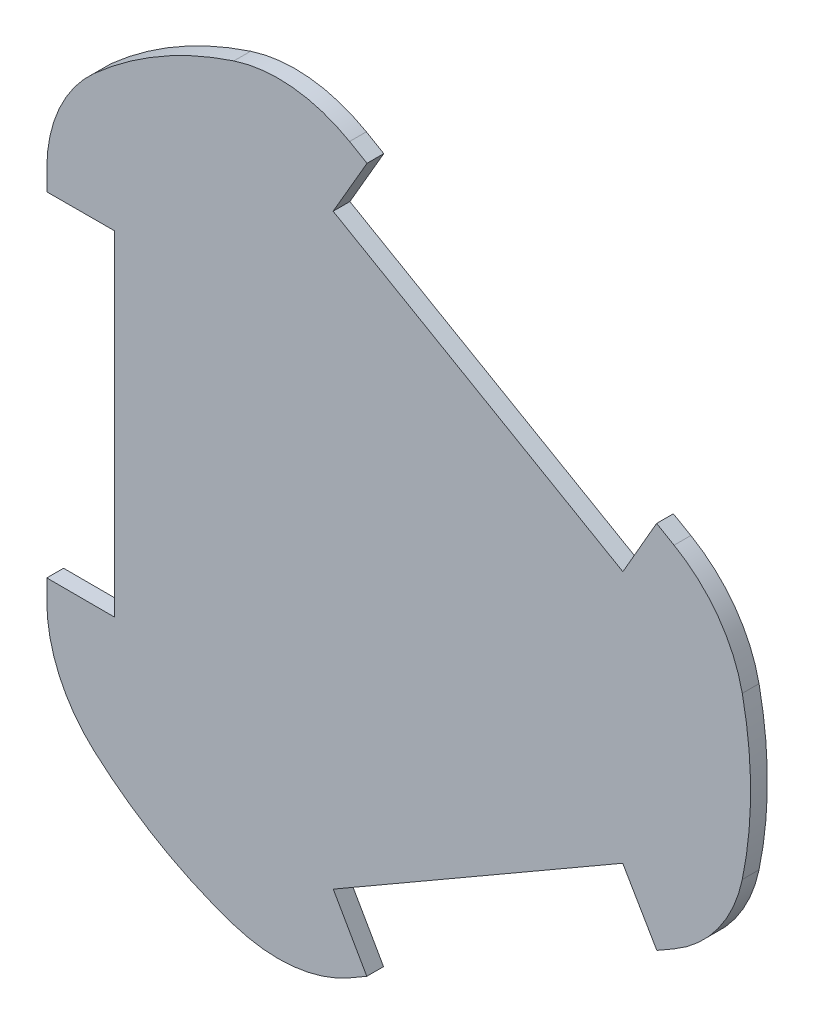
ISO-10303-21;
HEADER;
FILE_DESCRIPTION(('STEP AP214'),'2;1');
FILE_NAME('part.step','',(''),(''),'','','');
FILE_SCHEMA(('AUTOMOTIVE_DESIGN { 1 0 10303 214 1 1 1 1 }'));
ENDSEC;
DATA;
#1=APPLICATION_CONTEXT('core data for automotive mechanical design processes');
#2=APPLICATION_PROTOCOL_DEFINITION('international standard','automotive_design',2000,#1);
#3=PRODUCT_CONTEXT('',#1,'mechanical');
#4=PRODUCT('Part','Part','',(#3));
#5=PRODUCT_RELATED_PRODUCT_CATEGORY('part','',(#4));
#6=PRODUCT_DEFINITION_FORMATION('','',#4);
#7=PRODUCT_DEFINITION_CONTEXT('part definition',#1,'design');
#8=PRODUCT_DEFINITION('design','',#6,#7);
#9=PRODUCT_DEFINITION_SHAPE('','',#8);
#10=(LENGTH_UNIT() NAMED_UNIT(*) SI_UNIT(.MILLI.,.METRE.));
#11=(NAMED_UNIT(*) PLANE_ANGLE_UNIT() SI_UNIT($,.RADIAN.));
#12=(NAMED_UNIT(*) SI_UNIT($,.STERADIAN.) SOLID_ANGLE_UNIT());
#13=UNCERTAINTY_MEASURE_WITH_UNIT(LENGTH_MEASURE(1.E-05),#10,'distance_accuracy_value','');
#14=(GEOMETRIC_REPRESENTATION_CONTEXT(3) GLOBAL_UNCERTAINTY_ASSIGNED_CONTEXT((#13)) GLOBAL_UNIT_ASSIGNED_CONTEXT((#10,
#11,#12)) REPRESENTATION_CONTEXT('',''));
#15=CARTESIAN_POINT('',(0.,0.,0.));
#16=DIRECTION('',(0.,0.,1.));
#17=DIRECTION('',(1.,0.,0.));
#18=AXIS2_PLACEMENT_3D('',#15,#16,#17);
#19=CARTESIAN_POINT('',(24.3649167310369,6.14016818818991,0.));
#20=DIRECTION('',(0.,0.,1.));
#21=DIRECTION('',(1.,0.,0.));
#22=AXIS2_PLACEMENT_3D('',#19,#20,#21);
#23=PLANE('',#22);
#24=CARTESIAN_POINT('',(34.9999999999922,3.2533004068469E-11,0.));
#25=DIRECTION('',(0.,0.,1.));
#26=DIRECTION('',(1.,0.,0.));
#27=AXIS2_PLACEMENT_3D('',#24,#25,#26);
#28=CIRCLE('',#27,4.);
#29=CARTESIAN_POINT('',(38.9999999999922,3.2533004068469E-11,0.));
#30=VERTEX_POINT('',#29);
#31=EDGE_CURVE('E48',#30,#30,#28,.F.);
#32=ORIENTED_EDGE('',*,*,#31,.F.);
#33=EDGE_LOOP('',(#32));
#34=FACE_BOUND('',#33,.T.);
#35=DIRECTION('',(-0.498246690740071,-0.867035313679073,0.));
#36=VECTOR('',#35,1.);
#37=CARTESIAN_POINT('',(26.7547595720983,15.0665843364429,0.));
#38=LINE('',#37,#36);
#39=CARTESIAN_POINT('',(30.7778982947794,22.0675407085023,0.));
#40=VERTEX_POINT('',#39);
#41=CARTESIAN_POINT('',(26.7547595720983,15.0665843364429,0.));
#42=VERTEX_POINT('',#41);
#43=EDGE_CURVE('E258',#40,#42,#38,.T.);
#44=ORIENTED_EDGE('',*,*,#43,.F.);
#45=DIRECTION('',(-0.866025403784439,0.499999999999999,0.));
#46=VECTOR('',#45,1.);
#47=CARTESIAN_POINT('',(32.8649167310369,20.8626000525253,0.));
#48=LINE('',#47,#46);
#49=CARTESIAN_POINT('',(32.8649167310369,20.8626000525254,0.));
#50=VERTEX_POINT('',#49);
#51=EDGE_CURVE('E149',#50,#40,#48,.T.);
#52=ORIENTED_EDGE('',*,*,#51,.F.);
#53=CARTESIAN_POINT('',(24.3649167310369,6.14016818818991,0.));
#54=DIRECTION('',(0.,0.,1.));
#55=DIRECTION('',(1.,0.,0.));
#56=AXIS2_PLACEMENT_3D('',#53,#54,#55);
#57=CIRCLE('',#56,17.);
#58=CARTESIAN_POINT('',(41.0050362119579,9.61959682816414,0.));
#59=VERTEX_POINT('',#58);
#60=EDGE_CURVE('E143',#59,#50,#57,.T.);
#61=ORIENTED_EDGE('',*,*,#60,.F.);
#62=CARTESIAN_POINT('',(-5.0000000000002,0.,0.));
#63=DIRECTION('',(0.,0.,1.));
#64=DIRECTION('',(1.,0.,0.));
#65=AXIS2_PLACEMENT_3D('',#62,#63,#64);
#66=CIRCLE('',#65,47.);
#67=CARTESIAN_POINT('',(41.0050362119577,-9.61959682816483,0.));
#68=VERTEX_POINT('',#67);
#69=EDGE_CURVE('E244',#68,#59,#66,.T.);
#70=ORIENTED_EDGE('',*,*,#69,.F.);
#71=CARTESIAN_POINT('',(24.3649167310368,-6.14016818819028,0.));
#72=DIRECTION('',(0.,0.,1.));
#73=DIRECTION('',(1.,0.,0.));
#74=AXIS2_PLACEMENT_3D('',#71,#72,#73);
#75=CIRCLE('',#74,17.);
#76=CARTESIAN_POINT('',(32.8649167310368,-20.8626000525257,0.));
#77=VERTEX_POINT('',#76);
#78=EDGE_CURVE('E319',#77,#68,#75,.T.);
#79=ORIENTED_EDGE('',*,*,#78,.F.);
#80=DIRECTION('',(0.866025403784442,0.499999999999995,0.));
#81=VECTOR('',#80,1.);
#82=CARTESIAN_POINT('',(30.8072038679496,-22.0506211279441,0.));
#83=LINE('',#82,#81);
#84=CARTESIAN_POINT('',(30.8072038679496,-22.0506211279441,0.));
#85=VERTEX_POINT('',#84);
#86=EDGE_CURVE('E316',#85,#77,#83,.T.);
#87=ORIENTED_EDGE('',*,*,#86,.F.);
#88=DIRECTION('',(0.504242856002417,-0.863561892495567,0.));
#89=VECTOR('',#88,1.);
#90=CARTESIAN_POINT('',(26.7356087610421,-15.0776430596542,0.));
#91=LINE('',#90,#89);
#92=CARTESIAN_POINT('',(26.7356087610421,-15.0776430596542,0.));
#93=VERTEX_POINT('',#92);
#94=EDGE_CURVE('E314',#93,#85,#91,.T.);
#95=ORIENTED_EDGE('',*,*,#94,.F.);
#96=DIRECTION('',(0.866025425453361,0.499999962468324,0.));
#97=VECTOR('',#96,1.);
#98=CARTESIAN_POINT('',(-7.811356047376,-35.0233404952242,0.));
#99=LINE('',#98,#97);
#100=CARTESIAN_POINT('',(-7.811356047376,-35.0233404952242,0.));
#101=VERTEX_POINT('',#100);
#102=EDGE_CURVE('E311',#101,#93,#99,.T.);
#103=ORIENTED_EDGE('',*,*,#102,.F.);
#104=DIRECTION('',(-0.495744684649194,0.868468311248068,0.));
#105=VECTOR('',#104,1.);
#106=CARTESIAN_POINT('',(-3.80838001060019,-42.0359377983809,0.));
#107=LINE('',#106,#105);
#108=CARTESIAN_POINT('',(-3.80838001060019,-42.0359377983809,0.));
#109=VERTEX_POINT('',#108);
#110=EDGE_CURVE('E308',#109,#101,#107,.T.);
#111=ORIENTED_EDGE('',*,*,#110,.F.);
#112=DIRECTION('',(0.86602540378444,0.499999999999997,0.));
#113=VECTOR('',#112,1.);
#114=CARTESIAN_POINT('',(-5.86491673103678,-43.2232798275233,0.));
#115=LINE('',#114,#113);
#116=CARTESIAN_POINT('',(-5.86491673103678,-43.2232798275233,0.));
#117=VERTEX_POINT('',#116);
#118=EDGE_CURVE('E306',#117,#109,#115,.T.);
#119=ORIENTED_EDGE('',*,*,#118,.F.);
#120=CARTESIAN_POINT('',(-14.3649167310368,-28.5008479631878,0.));
#121=DIRECTION('',(0.,0.,1.));
#122=DIRECTION('',(1.,0.,0.));
#123=AXIS2_PLACEMENT_3D('',#120,#121,#122);
#124=CIRCLE('',#123,17.);
#125=CARTESIAN_POINT('',(-19.6717028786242,-44.6513284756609,0.));
#126=VERTEX_POINT('',#125);
#127=EDGE_CURVE('E303',#126,#117,#124,.T.);
#128=ORIENTED_EDGE('',*,*,#127,.F.);
#129=CARTESIAN_POINT('',(-5.0000000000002,0.,0.));
#130=DIRECTION('',(0.,0.,1.));
#131=DIRECTION('',(1.,0.,0.));
#132=AXIS2_PLACEMENT_3D('',#129,#130,#131);
#133=CIRCLE('',#132,47.);
#134=CARTESIAN_POINT('',(-36.3333333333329,-35.0317316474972,0.));
#135=VERTEX_POINT('',#134);
#136=EDGE_CURVE('E299',#135,#126,#133,.T.);
#137=ORIENTED_EDGE('',*,*,#136,.F.);
#138=CARTESIAN_POINT('',(-24.9999999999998,-22.3606797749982,0.));
#139=DIRECTION('',(0.,0.,1.));
#140=DIRECTION('',(1.,0.,0.));
#141=AXIS2_PLACEMENT_3D('',#138,#139,#140);
#142=CIRCLE('',#141,17.);
#143=CARTESIAN_POINT('',(-41.9999999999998,-22.3606797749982,0.));
#144=VERTEX_POINT('',#143);
#145=EDGE_CURVE('E296',#144,#135,#142,.T.);
#146=ORIENTED_EDGE('',*,*,#145,.F.);
#147=DIRECTION('',(0.,-1.,0.));
#148=VECTOR('',#147,1.);
#149=CARTESIAN_POINT('',(-41.9999999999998,-19.9494445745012,0.));
#150=LINE('',#149,#148);
#151=CARTESIAN_POINT('',(-41.9999999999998,-19.9494445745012,0.));
#152=VERTEX_POINT('',#151);
#153=EDGE_CURVE('E293',#152,#144,#150,.T.);
#154=ORIENTED_EDGE('',*,*,#153,.F.);
#155=DIRECTION('',(-0.999997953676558,0.00202302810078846,0.));
#156=VECTOR('',#155,1.);
#157=CARTESIAN_POINT('',(-33.9254246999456,-19.9657797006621,0.));
#158=LINE('',#157,#156);
#159=CARTESIAN_POINT('',(-33.9254246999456,-19.9657797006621,0.));
#160=VERTEX_POINT('',#159);
#161=EDGE_CURVE('E290',#160,#152,#158,.T.);
#162=ORIENTED_EDGE('',*,*,#161,.F.);
#163=DIRECTION('',(0.,-1.,0.));
#164=VECTOR('',#163,1.);
#165=CARTESIAN_POINT('',(-33.9254246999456,19.967136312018,0.));
#166=LINE('',#165,#164);
#167=CARTESIAN_POINT('',(-33.9254246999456,19.967136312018,0.));
#168=VERTEX_POINT('',#167);
#169=EDGE_CURVE('E287',#168,#160,#166,.T.);
#170=ORIENTED_EDGE('',*,*,#169,.F.);
#171=DIRECTION('',(0.999997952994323,0.0020233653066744,0.));
#172=VECTOR('',#171,1.);
#173=CARTESIAN_POINT('',(-41.9999999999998,19.950798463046,0.));
#174=LINE('',#173,#172);
#175=CARTESIAN_POINT('',(-41.9999999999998,19.950798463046,0.));
#176=VERTEX_POINT('',#175);
#177=EDGE_CURVE('E284',#176,#168,#174,.T.);
#178=ORIENTED_EDGE('',*,*,#177,.F.);
#179=DIRECTION('',(0.,-1.,0.));
#180=VECTOR('',#179,1.);
#181=CARTESIAN_POINT('',(-41.9999999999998,22.3606797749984,0.));
#182=LINE('',#181,#180);
#183=CARTESIAN_POINT('',(-41.9999999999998,22.3606797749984,0.));
#184=VERTEX_POINT('',#183);
#185=EDGE_CURVE('E281',#184,#176,#182,.T.);
#186=ORIENTED_EDGE('',*,*,#185,.F.);
#187=CARTESIAN_POINT('',(-24.9999999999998,22.3606797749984,0.));
#188=DIRECTION('',(0.,0.,1.));
#189=DIRECTION('',(1.,0.,0.));
#190=AXIS2_PLACEMENT_3D('',#187,#188,#189);
#191=CIRCLE('',#190,17.);
#192=CARTESIAN_POINT('',(-36.3333333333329,35.0317316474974,0.));
#193=VERTEX_POINT('',#192);
#194=EDGE_CURVE('E279',#193,#184,#191,.T.);
#195=ORIENTED_EDGE('',*,*,#194,.F.);
#196=CARTESIAN_POINT('',(-5.0000000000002,0.,0.));
#197=DIRECTION('',(0.,0.,1.));
#198=DIRECTION('',(1.,0.,0.));
#199=AXIS2_PLACEMENT_3D('',#196,#197,#198);
#200=CIRCLE('',#199,47.);
#201=CARTESIAN_POINT('',(-19.671702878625,44.6513284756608,0.));
#202=VERTEX_POINT('',#201);
#203=EDGE_CURVE('E275',#202,#193,#200,.T.);
#204=ORIENTED_EDGE('',*,*,#203,.F.);
#205=CARTESIAN_POINT('',(-14.3649167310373,28.5008479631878,0.));
#206=DIRECTION('',(0.,0.,1.));
#207=DIRECTION('',(1.,0.,0.));
#208=AXIS2_PLACEMENT_3D('',#205,#206,#207);
#209=CIRCLE('',#208,17.);
#210=CARTESIAN_POINT('',(-5.86491673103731,43.2232798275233,0.));
#211=VERTEX_POINT('',#210);
#212=EDGE_CURVE('E272',#211,#202,#209,.T.);
#213=ORIENTED_EDGE('',*,*,#212,.F.);
#214=DIRECTION('',(-0.866025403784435,0.500000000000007,0.));
#215=VECTOR('',#214,1.);
#216=CARTESIAN_POINT('',(-3.77672579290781,42.0176622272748,0.));
#217=LINE('',#216,#215);
#218=CARTESIAN_POINT('',(-3.77672579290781,42.0176622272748,0.));
#219=VERTEX_POINT('',#218);
#220=EDGE_CURVE('E268',#219,#211,#217,.T.);
#221=ORIENTED_EDGE('',*,*,#220,.F.);
#222=DIRECTION('',(0.501750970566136,0.865012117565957,0.));
#223=VECTOR('',#222,1.);
#224=CARTESIAN_POINT('',(-7.82815927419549,35.0330438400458,0.));
#225=LINE('',#224,#223);
#226=CARTESIAN_POINT('',(-7.82815927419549,35.0330438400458,0.));
#227=VERTEX_POINT('',#226);
#228=EDGE_CURVE('E265',#227,#219,#225,.T.);
#229=ORIENTED_EDGE('',*,*,#228,.F.);
#230=DIRECTION('',(-0.866025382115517,0.500000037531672,0.));
#231=VECTOR('',#230,1.);
#232=CARTESIAN_POINT('',(26.7547595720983,15.0665843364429,0.));
#233=LINE('',#232,#231);
#234=EDGE_CURVE('E261',#42,#227,#233,.T.);
#235=ORIENTED_EDGE('',*,*,#234,.F.);
#236=EDGE_LOOP('',(#44,#52,#61,#70,#79,#87,#95,#103,#111,#119,#128,#137,#146,#154,#162,#170,
#178,#186,#195,#204,#213,#221,#229,#235));
#237=FACE_BOUND('',#236,.T.);
#238=CARTESIAN_POINT('',(-25.0000000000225,34.6410161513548,0.));
#239=DIRECTION('',(0.,0.,1.));
#240=DIRECTION('',(1.,0.,0.));
#241=AXIS2_PLACEMENT_3D('',#238,#239,#240);
#242=CIRCLE('',#241,4.);
#243=CARTESIAN_POINT('',(-21.0000000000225,34.6410161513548,0.));
#244=VERTEX_POINT('',#243);
#245=EDGE_CURVE('E398',#244,#244,#242,.F.);
#246=ORIENTED_EDGE('',*,*,#245,.F.);
#247=EDGE_LOOP('',(#246));
#248=FACE_BOUND('',#247,.T.);
#249=CARTESIAN_POINT('',(-24.9999999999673,-34.6410161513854,0.));
#250=DIRECTION('',(0.,0.,1.));
#251=DIRECTION('',(1.,0.,0.));
#252=AXIS2_PLACEMENT_3D('',#249,#250,#251);
#253=CIRCLE('',#252,4.);
#254=CARTESIAN_POINT('',(-20.9999999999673,-34.6410161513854,0.));
#255=VERTEX_POINT('',#254);
#256=EDGE_CURVE('E11',#255,#255,#253,.F.);
#257=ORIENTED_EDGE('',*,*,#256,.F.);
#258=EDGE_LOOP('',(#257));
#259=FACE_BOUND('',#258,.T.);
#260=ADVANCED_FACE('F38',(#34,#237,#248,#259),#23,.F.);
#261=CARTESIAN_POINT('',(24.3649167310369,6.14016818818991,2.));
#262=DIRECTION('',(0.,0.,1.));
#263=DIRECTION('',(1.,0.,0.));
#264=AXIS2_PLACEMENT_3D('',#261,#262,#263);
#265=PLANE('',#264);
#266=DIRECTION('',(-0.498246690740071,-0.867035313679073,0.));
#267=VECTOR('',#266,1.);
#268=CARTESIAN_POINT('',(26.7547595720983,15.0665843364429,2.));
#269=LINE('',#268,#267);
#270=CARTESIAN_POINT('',(30.7778982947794,22.0675407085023,2.));
#271=VERTEX_POINT('',#270);
#272=CARTESIAN_POINT('',(26.7547595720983,15.0665843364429,2.));
#273=VERTEX_POINT('',#272);
#274=EDGE_CURVE('E325',#271,#273,#269,.T.);
#275=ORIENTED_EDGE('',*,*,#274,.T.);
#276=DIRECTION('',(-0.866025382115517,0.500000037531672,0.));
#277=VECTOR('',#276,1.);
#278=CARTESIAN_POINT('',(26.7547595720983,15.0665843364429,2.));
#279=LINE('',#278,#277);
#280=CARTESIAN_POINT('',(-7.82815927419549,35.0330438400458,2.));
#281=VERTEX_POINT('',#280);
#282=EDGE_CURVE('E158',#273,#281,#279,.T.);
#283=ORIENTED_EDGE('',*,*,#282,.T.);
#284=DIRECTION('',(0.501750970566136,0.865012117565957,0.));
#285=VECTOR('',#284,1.);
#286=CARTESIAN_POINT('',(-7.82815927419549,35.0330438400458,2.));
#287=LINE('',#286,#285);
#288=CARTESIAN_POINT('',(-3.77672579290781,42.0176622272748,2.));
#289=VERTEX_POINT('',#288);
#290=EDGE_CURVE('E536',#281,#289,#287,.T.);
#291=ORIENTED_EDGE('',*,*,#290,.T.);
#292=DIRECTION('',(-0.866025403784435,0.500000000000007,0.));
#293=VECTOR('',#292,1.);
#294=CARTESIAN_POINT('',(-3.77672579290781,42.0176622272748,2.));
#295=LINE('',#294,#293);
#296=CARTESIAN_POINT('',(-5.86491673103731,43.2232798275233,2.));
#297=VERTEX_POINT('',#296);
#298=EDGE_CURVE('E547',#289,#297,#295,.T.);
#299=ORIENTED_EDGE('',*,*,#298,.T.);
#300=CARTESIAN_POINT('',(-14.3649167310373,28.5008479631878,2.));
#301=DIRECTION('',(0.,0.,1.));
#302=DIRECTION('',(1.,0.,0.));
#303=AXIS2_PLACEMENT_3D('',#300,#301,#302);
#304=CIRCLE('',#303,17.);
#305=CARTESIAN_POINT('',(-19.671702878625,44.6513284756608,2.));
#306=VERTEX_POINT('',#305);
#307=EDGE_CURVE('E543',#297,#306,#304,.T.);
#308=ORIENTED_EDGE('',*,*,#307,.T.);
#309=CARTESIAN_POINT('',(-5.0000000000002,0.,2.));
#310=DIRECTION('',(0.,0.,1.));
#311=DIRECTION('',(1.,0.,0.));
#312=AXIS2_PLACEMENT_3D('',#309,#310,#311);
#313=CIRCLE('',#312,47.);
#314=CARTESIAN_POINT('',(-36.3333333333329,35.0317316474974,2.));
#315=VERTEX_POINT('',#314);
#316=EDGE_CURVE('E546',#306,#315,#313,.T.);
#317=ORIENTED_EDGE('',*,*,#316,.T.);
#318=CARTESIAN_POINT('',(-24.9999999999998,22.3606797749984,2.));
#319=DIRECTION('',(0.,0.,1.));
#320=DIRECTION('',(1.,0.,0.));
#321=AXIS2_PLACEMENT_3D('',#318,#319,#320);
#322=CIRCLE('',#321,17.);
#323=CARTESIAN_POINT('',(-41.9999999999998,22.3606797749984,2.));
#324=VERTEX_POINT('',#323);
#325=EDGE_CURVE('E550',#315,#324,#322,.T.);
#326=ORIENTED_EDGE('',*,*,#325,.T.);
#327=DIRECTION('',(0.,-1.,0.));
#328=VECTOR('',#327,1.);
#329=CARTESIAN_POINT('',(-41.9999999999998,22.3606797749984,2.));
#330=LINE('',#329,#328);
#331=CARTESIAN_POINT('',(-41.9999999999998,19.950798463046,2.));
#332=VERTEX_POINT('',#331);
#333=EDGE_CURVE('E557',#324,#332,#330,.T.);
#334=ORIENTED_EDGE('',*,*,#333,.T.);
#335=DIRECTION('',(0.999997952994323,0.0020233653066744,0.));
#336=VECTOR('',#335,1.);
#337=CARTESIAN_POINT('',(-41.9999999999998,19.950798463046,2.));
#338=LINE('',#337,#336);
#339=CARTESIAN_POINT('',(-33.9254246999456,19.967136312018,2.));
#340=VERTEX_POINT('',#339);
#341=EDGE_CURVE('E559',#332,#340,#338,.T.);
#342=ORIENTED_EDGE('',*,*,#341,.T.);
#343=DIRECTION('',(0.,-1.,0.));
#344=VECTOR('',#343,1.);
#345=CARTESIAN_POINT('',(-33.9254246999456,19.967136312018,2.));
#346=LINE('',#345,#344);
#347=CARTESIAN_POINT('',(-33.9254246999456,-19.9657797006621,2.));
#348=VERTEX_POINT('',#347);
#349=EDGE_CURVE('E561',#340,#348,#346,.T.);
#350=ORIENTED_EDGE('',*,*,#349,.T.);
#351=DIRECTION('',(-0.999997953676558,0.00202302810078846,0.));
#352=VECTOR('',#351,1.);
#353=CARTESIAN_POINT('',(-33.9254246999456,-19.9657797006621,2.));
#354=LINE('',#353,#352);
#355=CARTESIAN_POINT('',(-41.9999999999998,-19.9494445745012,2.));
#356=VERTEX_POINT('',#355);
#357=EDGE_CURVE('E564',#348,#356,#354,.T.);
#358=ORIENTED_EDGE('',*,*,#357,.T.);
#359=DIRECTION('',(0.,-1.,0.));
#360=VECTOR('',#359,1.);
#361=CARTESIAN_POINT('',(-41.9999999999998,-19.9494445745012,2.));
#362=LINE('',#361,#360);
#363=CARTESIAN_POINT('',(-41.9999999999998,-22.3606797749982,2.));
#364=VERTEX_POINT('',#363);
#365=EDGE_CURVE('E567',#356,#364,#362,.T.);
#366=ORIENTED_EDGE('',*,*,#365,.T.);
#367=CARTESIAN_POINT('',(-24.9999999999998,-22.3606797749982,2.));
#368=DIRECTION('',(0.,0.,1.));
#369=DIRECTION('',(1.,0.,0.));
#370=AXIS2_PLACEMENT_3D('',#367,#368,#369);
#371=CIRCLE('',#370,17.);
#372=CARTESIAN_POINT('',(-36.3333333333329,-35.0317316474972,2.));
#373=VERTEX_POINT('',#372);
#374=EDGE_CURVE('E569',#364,#373,#371,.T.);
#375=ORIENTED_EDGE('',*,*,#374,.T.);
#376=CARTESIAN_POINT('',(-5.0000000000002,0.,2.));
#377=DIRECTION('',(0.,0.,1.));
#378=DIRECTION('',(1.,0.,0.));
#379=AXIS2_PLACEMENT_3D('',#376,#377,#378);
#380=CIRCLE('',#379,47.);
#381=CARTESIAN_POINT('',(-19.6717028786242,-44.6513284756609,2.));
#382=VERTEX_POINT('',#381);
#383=EDGE_CURVE('E572',#373,#382,#380,.T.);
#384=ORIENTED_EDGE('',*,*,#383,.T.);
#385=CARTESIAN_POINT('',(-14.3649167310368,-28.5008479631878,2.));
#386=DIRECTION('',(0.,0.,1.));
#387=DIRECTION('',(1.,0.,0.));
#388=AXIS2_PLACEMENT_3D('',#385,#386,#387);
#389=CIRCLE('',#388,17.);
#390=CARTESIAN_POINT('',(-5.86491673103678,-43.2232798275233,2.));
#391=VERTEX_POINT('',#390);
#392=EDGE_CURVE('E575',#382,#391,#389,.T.);
#393=ORIENTED_EDGE('',*,*,#392,.T.);
#394=DIRECTION('',(0.86602540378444,0.499999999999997,0.));
#395=VECTOR('',#394,1.);
#396=CARTESIAN_POINT('',(-5.86491673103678,-43.2232798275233,2.));
#397=LINE('',#396,#395);
#398=CARTESIAN_POINT('',(-3.80838001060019,-42.0359377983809,2.));
#399=VERTEX_POINT('',#398);
#400=EDGE_CURVE('E578',#391,#399,#397,.T.);
#401=ORIENTED_EDGE('',*,*,#400,.T.);
#402=DIRECTION('',(-0.495744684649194,0.868468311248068,0.));
#403=VECTOR('',#402,1.);
#404=CARTESIAN_POINT('',(-3.80838001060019,-42.0359377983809,2.));
#405=LINE('',#404,#403);
#406=CARTESIAN_POINT('',(-7.811356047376,-35.0233404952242,2.));
#407=VERTEX_POINT('',#406);
#408=EDGE_CURVE('E580',#399,#407,#405,.T.);
#409=ORIENTED_EDGE('',*,*,#408,.T.);
#410=DIRECTION('',(0.866025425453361,0.499999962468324,0.));
#411=VECTOR('',#410,1.);
#412=CARTESIAN_POINT('',(-7.811356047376,-35.0233404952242,2.));
#413=LINE('',#412,#411);
#414=CARTESIAN_POINT('',(26.7356087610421,-15.0776430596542,2.));
#415=VERTEX_POINT('',#414);
#416=EDGE_CURVE('E583',#407,#415,#413,.T.);
#417=ORIENTED_EDGE('',*,*,#416,.T.);
#418=DIRECTION('',(0.504242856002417,-0.863561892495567,0.));
#419=VECTOR('',#418,1.);
#420=CARTESIAN_POINT('',(26.7356087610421,-15.0776430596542,2.));
#421=LINE('',#420,#419);
#422=CARTESIAN_POINT('',(30.8072038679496,-22.0506211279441,2.));
#423=VERTEX_POINT('',#422);
#424=EDGE_CURVE('E586',#415,#423,#421,.T.);
#425=ORIENTED_EDGE('',*,*,#424,.T.);
#426=DIRECTION('',(0.866025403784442,0.499999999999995,0.));
#427=VECTOR('',#426,1.);
#428=CARTESIAN_POINT('',(30.8072038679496,-22.0506211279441,2.));
#429=LINE('',#428,#427);
#430=CARTESIAN_POINT('',(32.8649167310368,-20.8626000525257,2.));
#431=VERTEX_POINT('',#430);
#432=EDGE_CURVE('E588',#423,#431,#429,.T.);
#433=ORIENTED_EDGE('',*,*,#432,.T.);
#434=CARTESIAN_POINT('',(24.3649167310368,-6.14016818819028,2.));
#435=DIRECTION('',(0.,0.,1.));
#436=DIRECTION('',(1.,0.,0.));
#437=AXIS2_PLACEMENT_3D('',#434,#435,#436);
#438=CIRCLE('',#437,17.);
#439=CARTESIAN_POINT('',(41.0050362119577,-9.61959682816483,2.));
#440=VERTEX_POINT('',#439);
#441=EDGE_CURVE('E234',#431,#440,#438,.T.);
#442=ORIENTED_EDGE('',*,*,#441,.T.);
#443=CARTESIAN_POINT('',(-5.0000000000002,0.,2.));
#444=DIRECTION('',(0.,0.,1.));
#445=DIRECTION('',(1.,0.,0.));
#446=AXIS2_PLACEMENT_3D('',#443,#444,#445);
#447=CIRCLE('',#446,47.);
#448=CARTESIAN_POINT('',(41.0050362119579,9.61959682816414,2.));
#449=VERTEX_POINT('',#448);
#450=EDGE_CURVE('E228',#440,#449,#447,.T.);
#451=ORIENTED_EDGE('',*,*,#450,.T.);
#452=CARTESIAN_POINT('',(24.3649167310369,6.14016818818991,2.));
#453=DIRECTION('',(0.,0.,1.));
#454=DIRECTION('',(1.,0.,0.));
#455=AXIS2_PLACEMENT_3D('',#452,#453,#454);
#456=CIRCLE('',#455,17.);
#457=CARTESIAN_POINT('',(32.8649167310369,20.8626000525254,2.));
#458=VERTEX_POINT('',#457);
#459=EDGE_CURVE('E232',#449,#458,#456,.T.);
#460=ORIENTED_EDGE('',*,*,#459,.T.);
#461=DIRECTION('',(-0.866025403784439,0.499999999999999,0.));
#462=VECTOR('',#461,1.);
#463=CARTESIAN_POINT('',(32.8649167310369,20.8626000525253,2.));
#464=LINE('',#463,#462);
#465=EDGE_CURVE('E56',#458,#271,#464,.T.);
#466=ORIENTED_EDGE('',*,*,#465,.T.);
#467=EDGE_LOOP('',(#275,#283,#291,#299,#308,#317,#326,#334,#342,#350,#358,#366,#375,#384,#393,
#401,#409,#417,#425,#433,#442,#451,#460,#466));
#468=FACE_BOUND('',#467,.T.);
#469=ADVANCED_FACE('F230',(#468),#265,.T.);
#470=CARTESIAN_POINT('',(26.7547595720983,15.0665843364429,2.));
#471=DIRECTION('',(0.867035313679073,-0.498246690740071,0.));
#472=DIRECTION('',(0.498246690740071,0.867035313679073,0.));
#473=AXIS2_PLACEMENT_3D('',#470,#471,#472);
#474=PLANE('',#473);
#475=ORIENTED_EDGE('',*,*,#43,.T.);
#476=DIRECTION('',(0.,0.,-1.));
#477=VECTOR('',#476,1.);
#478=CARTESIAN_POINT('',(26.7547595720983,15.0665843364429,2.));
#479=LINE('',#478,#477);
#480=EDGE_CURVE('E396',#273,#42,#479,.T.);
#481=ORIENTED_EDGE('',*,*,#480,.F.);
#482=ORIENTED_EDGE('',*,*,#274,.F.);
#483=DIRECTION('',(0.,0.,-1.));
#484=VECTOR('',#483,1.);
#485=CARTESIAN_POINT('',(30.7778982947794,22.0675407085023,2.));
#486=LINE('',#485,#484);
#487=EDGE_CURVE('E254',#271,#40,#486,.T.);
#488=ORIENTED_EDGE('',*,*,#487,.T.);
#489=EDGE_LOOP('',(#475,#481,#482,#488));
#490=FACE_BOUND('',#489,.T.);
#491=ADVANCED_FACE('F40',(#490),#474,.F.);
#492=CARTESIAN_POINT('',(26.7547595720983,15.0665843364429,2.));
#493=DIRECTION('',(-0.500000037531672,-0.866025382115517,0.));
#494=DIRECTION('',(0.866025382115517,-0.500000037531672,0.));
#495=AXIS2_PLACEMENT_3D('',#492,#493,#494);
#496=PLANE('',#495);
#497=ORIENTED_EDGE('',*,*,#234,.T.);
#498=DIRECTION('',(0.,0.,-1.));
#499=VECTOR('',#498,1.);
#500=CARTESIAN_POINT('',(-7.82815927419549,35.0330438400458,2.));
#501=LINE('',#500,#499);
#502=EDGE_CURVE('E392',#281,#227,#501,.T.);
#503=ORIENTED_EDGE('',*,*,#502,.F.);
#504=ORIENTED_EDGE('',*,*,#282,.F.);
#505=ORIENTED_EDGE('',*,*,#480,.T.);
#506=EDGE_LOOP('',(#497,#503,#504,#505));
#507=FACE_BOUND('',#506,.T.);
#508=ADVANCED_FACE('F525',(#507),#496,.F.);
#509=CARTESIAN_POINT('',(-7.82815927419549,35.0330438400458,2.));
#510=DIRECTION('',(-0.865012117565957,0.501750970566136,0.));
#511=DIRECTION('',(-0.501750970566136,-0.865012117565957,0.));
#512=AXIS2_PLACEMENT_3D('',#509,#510,#511);
#513=PLANE('',#512);
#514=ORIENTED_EDGE('',*,*,#228,.T.);
#515=DIRECTION('',(0.,0.,-1.));
#516=VECTOR('',#515,1.);
#517=CARTESIAN_POINT('',(-3.77672579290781,42.0176622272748,2.));
#518=LINE('',#517,#516);
#519=EDGE_CURVE('E388',#289,#219,#518,.T.);
#520=ORIENTED_EDGE('',*,*,#519,.F.);
#521=ORIENTED_EDGE('',*,*,#290,.F.);
#522=ORIENTED_EDGE('',*,*,#502,.T.);
#523=EDGE_LOOP('',(#514,#520,#521,#522));
#524=FACE_BOUND('',#523,.T.);
#525=ADVANCED_FACE('F522',(#524),#513,.F.);
#526=CARTESIAN_POINT('',(-3.77672579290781,42.0176622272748,2.));
#527=DIRECTION('',(-0.500000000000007,-0.866025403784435,0.));
#528=DIRECTION('',(0.866025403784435,-0.500000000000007,0.));
#529=AXIS2_PLACEMENT_3D('',#526,#527,#528);
#530=PLANE('',#529);
#531=ORIENTED_EDGE('',*,*,#220,.T.);
#532=DIRECTION('',(0.,0.,-1.));
#533=VECTOR('',#532,1.);
#534=CARTESIAN_POINT('',(-5.86491673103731,43.2232798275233,2.));
#535=LINE('',#534,#533);
#536=EDGE_CURVE('E384',#297,#211,#535,.T.);
#537=ORIENTED_EDGE('',*,*,#536,.F.);
#538=ORIENTED_EDGE('',*,*,#298,.F.);
#539=ORIENTED_EDGE('',*,*,#519,.T.);
#540=EDGE_LOOP('',(#531,#537,#538,#539));
#541=FACE_BOUND('',#540,.T.);
#542=ADVANCED_FACE('F518',(#541),#530,.F.);
#543=CARTESIAN_POINT('',(-14.3649167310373,28.5008479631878,2.));
#544=DIRECTION('',(0.,0.,-1.));
#545=DIRECTION('',(-1.,0.,0.));
#546=AXIS2_PLACEMENT_3D('',#543,#544,#545);
#547=CYLINDRICAL_SURFACE('',#546,17.);
#548=ORIENTED_EDGE('',*,*,#212,.T.);
#549=DIRECTION('',(0.,0.,-1.));
#550=VECTOR('',#549,1.);
#551=CARTESIAN_POINT('',(-19.671702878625,44.6513284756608,2.));
#552=LINE('',#551,#550);
#553=EDGE_CURVE('E380',#306,#202,#552,.T.);
#554=ORIENTED_EDGE('',*,*,#553,.F.);
#555=ORIENTED_EDGE('',*,*,#307,.F.);
#556=ORIENTED_EDGE('',*,*,#536,.T.);
#557=EDGE_LOOP('',(#548,#554,#555,#556));
#558=FACE_BOUND('',#557,.T.);
#559=ADVANCED_FACE('F514',(#558),#547,.T.);
#560=CARTESIAN_POINT('',(-5.0000000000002,0.,2.));
#561=DIRECTION('',(0.,0.,-1.));
#562=DIRECTION('',(-1.,0.,0.));
#563=AXIS2_PLACEMENT_3D('',#560,#561,#562);
#564=CYLINDRICAL_SURFACE('',#563,47.);
#565=ORIENTED_EDGE('',*,*,#203,.T.);
#566=DIRECTION('',(0.,0.,-1.));
#567=VECTOR('',#566,1.);
#568=CARTESIAN_POINT('',(-36.3333333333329,35.0317316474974,2.));
#569=LINE('',#568,#567);
#570=EDGE_CURVE('E377',#315,#193,#569,.T.);
#571=ORIENTED_EDGE('',*,*,#570,.F.);
#572=ORIENTED_EDGE('',*,*,#316,.F.);
#573=ORIENTED_EDGE('',*,*,#553,.T.);
#574=EDGE_LOOP('',(#565,#571,#572,#573));
#575=FACE_BOUND('',#574,.T.);
#576=ADVANCED_FACE('F510',(#575),#564,.T.);
#577=CARTESIAN_POINT('',(-24.9999999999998,22.3606797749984,2.));
#578=DIRECTION('',(0.,0.,-1.));
#579=DIRECTION('',(-1.,0.,0.));
#580=AXIS2_PLACEMENT_3D('',#577,#578,#579);
#581=CYLINDRICAL_SURFACE('',#580,17.);
#582=ORIENTED_EDGE('',*,*,#194,.T.);
#583=DIRECTION('',(0.,0.,-1.));
#584=VECTOR('',#583,1.);
#585=CARTESIAN_POINT('',(-41.9999999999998,22.3606797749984,2.));
#586=LINE('',#585,#584);
#587=EDGE_CURVE('E374',#324,#184,#586,.T.);
#588=ORIENTED_EDGE('',*,*,#587,.F.);
#589=ORIENTED_EDGE('',*,*,#325,.F.);
#590=ORIENTED_EDGE('',*,*,#570,.T.);
#591=EDGE_LOOP('',(#582,#588,#589,#590));
#592=FACE_BOUND('',#591,.T.);
#593=ADVANCED_FACE('F506',(#592),#581,.T.);
#594=CARTESIAN_POINT('',(-41.9999999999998,22.3606797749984,2.));
#595=DIRECTION('',(1.,0.,0.));
#596=DIRECTION('',(0.,0.,-1.));
#597=AXIS2_PLACEMENT_3D('',#594,#595,#596);
#598=PLANE('',#597);
#599=ORIENTED_EDGE('',*,*,#185,.T.);
#600=DIRECTION('',(0.,0.,-1.));
#601=VECTOR('',#600,1.);
#602=CARTESIAN_POINT('',(-41.9999999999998,19.950798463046,2.));
#603=LINE('',#602,#601);
#604=EDGE_CURVE('E370',#332,#176,#603,.T.);
#605=ORIENTED_EDGE('',*,*,#604,.F.);
#606=ORIENTED_EDGE('',*,*,#333,.F.);
#607=ORIENTED_EDGE('',*,*,#587,.T.);
#608=EDGE_LOOP('',(#599,#605,#606,#607));
#609=FACE_BOUND('',#608,.T.);
#610=ADVANCED_FACE('F502',(#609),#598,.F.);
#611=CARTESIAN_POINT('',(-41.9999999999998,19.950798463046,2.));
#612=DIRECTION('',(-0.0020233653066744,0.999997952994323,0.));
#613=DIRECTION('',(-0.999997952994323,-0.0020233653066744,0.));
#614=AXIS2_PLACEMENT_3D('',#611,#612,#613);
#615=PLANE('',#614);
#616=ORIENTED_EDGE('',*,*,#177,.T.);
#617=DIRECTION('',(0.,0.,-1.));
#618=VECTOR('',#617,1.);
#619=CARTESIAN_POINT('',(-33.9254246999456,19.967136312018,2.));
#620=LINE('',#619,#618);
#621=EDGE_CURVE('E367',#340,#168,#620,.T.);
#622=ORIENTED_EDGE('',*,*,#621,.F.);
#623=ORIENTED_EDGE('',*,*,#341,.F.);
#624=ORIENTED_EDGE('',*,*,#604,.T.);
#625=EDGE_LOOP('',(#616,#622,#623,#624));
#626=FACE_BOUND('',#625,.T.);
#627=ADVANCED_FACE('F498',(#626),#615,.F.);
#628=CARTESIAN_POINT('',(-33.9254246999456,19.967136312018,2.));
#629=DIRECTION('',(1.,0.,0.));
#630=DIRECTION('',(0.,0.,-1.));
#631=AXIS2_PLACEMENT_3D('',#628,#629,#630);
#632=PLANE('',#631);
#633=ORIENTED_EDGE('',*,*,#169,.T.);
#634=DIRECTION('',(0.,0.,-1.));
#635=VECTOR('',#634,1.);
#636=CARTESIAN_POINT('',(-33.9254246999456,-19.9657797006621,2.));
#637=LINE('',#636,#635);
#638=EDGE_CURVE('E363',#348,#160,#637,.T.);
#639=ORIENTED_EDGE('',*,*,#638,.F.);
#640=ORIENTED_EDGE('',*,*,#349,.F.);
#641=ORIENTED_EDGE('',*,*,#621,.T.);
#642=EDGE_LOOP('',(#633,#639,#640,#641));
#643=FACE_BOUND('',#642,.T.);
#644=ADVANCED_FACE('F494',(#643),#632,.F.);
#645=CARTESIAN_POINT('',(-33.9254246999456,-19.9657797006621,2.));
#646=DIRECTION('',(-0.00202302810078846,-0.999997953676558,0.));
#647=DIRECTION('',(0.999997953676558,-0.00202302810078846,0.));
#648=AXIS2_PLACEMENT_3D('',#645,#646,#647);
#649=PLANE('',#648);
#650=ORIENTED_EDGE('',*,*,#161,.T.);
#651=DIRECTION('',(0.,0.,-1.));
#652=VECTOR('',#651,1.);
#653=CARTESIAN_POINT('',(-41.9999999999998,-19.9494445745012,2.));
#654=LINE('',#653,#652);
#655=EDGE_CURVE('E360',#356,#152,#654,.T.);
#656=ORIENTED_EDGE('',*,*,#655,.F.);
#657=ORIENTED_EDGE('',*,*,#357,.F.);
#658=ORIENTED_EDGE('',*,*,#638,.T.);
#659=EDGE_LOOP('',(#650,#656,#657,#658));
#660=FACE_BOUND('',#659,.T.);
#661=ADVANCED_FACE('F490',(#660),#649,.F.);
#662=CARTESIAN_POINT('',(-41.9999999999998,-19.9494445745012,2.));
#663=DIRECTION('',(1.,0.,0.));
#664=DIRECTION('',(0.,0.,-1.));
#665=AXIS2_PLACEMENT_3D('',#662,#663,#664);
#666=PLANE('',#665);
#667=ORIENTED_EDGE('',*,*,#153,.T.);
#668=DIRECTION('',(0.,0.,-1.));
#669=VECTOR('',#668,1.);
#670=CARTESIAN_POINT('',(-41.9999999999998,-22.3606797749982,2.));
#671=LINE('',#670,#669);
#672=EDGE_CURVE('E357',#364,#144,#671,.T.);
#673=ORIENTED_EDGE('',*,*,#672,.F.);
#674=ORIENTED_EDGE('',*,*,#365,.F.);
#675=ORIENTED_EDGE('',*,*,#655,.T.);
#676=EDGE_LOOP('',(#667,#673,#674,#675));
#677=FACE_BOUND('',#676,.T.);
#678=ADVANCED_FACE('F486',(#677),#666,.F.);
#679=CARTESIAN_POINT('',(-24.9999999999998,-22.3606797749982,2.));
#680=DIRECTION('',(0.,0.,-1.));
#681=DIRECTION('',(-1.,0.,0.));
#682=AXIS2_PLACEMENT_3D('',#679,#680,#681);
#683=CYLINDRICAL_SURFACE('',#682,17.);
#684=ORIENTED_EDGE('',*,*,#145,.T.);
#685=DIRECTION('',(0.,0.,-1.));
#686=VECTOR('',#685,1.);
#687=CARTESIAN_POINT('',(-36.3333333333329,-35.0317316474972,2.));
#688=LINE('',#687,#686);
#689=EDGE_CURVE('E353',#373,#135,#688,.T.);
#690=ORIENTED_EDGE('',*,*,#689,.F.);
#691=ORIENTED_EDGE('',*,*,#374,.F.);
#692=ORIENTED_EDGE('',*,*,#672,.T.);
#693=EDGE_LOOP('',(#684,#690,#691,#692));
#694=FACE_BOUND('',#693,.T.);
#695=ADVANCED_FACE('F482',(#694),#683,.T.);
#696=CARTESIAN_POINT('',(-5.0000000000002,0.,2.));
#697=DIRECTION('',(0.,0.,-1.));
#698=DIRECTION('',(-1.,0.,0.));
#699=AXIS2_PLACEMENT_3D('',#696,#697,#698);
#700=CYLINDRICAL_SURFACE('',#699,47.);
#701=ORIENTED_EDGE('',*,*,#136,.T.);
#702=DIRECTION('',(0.,0.,-1.));
#703=VECTOR('',#702,1.);
#704=CARTESIAN_POINT('',(-19.6717028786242,-44.6513284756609,2.));
#705=LINE('',#704,#703);
#706=EDGE_CURVE('E349',#382,#126,#705,.T.);
#707=ORIENTED_EDGE('',*,*,#706,.F.);
#708=ORIENTED_EDGE('',*,*,#383,.F.);
#709=ORIENTED_EDGE('',*,*,#689,.T.);
#710=EDGE_LOOP('',(#701,#707,#708,#709));
#711=FACE_BOUND('',#710,.T.);
#712=ADVANCED_FACE('F478',(#711),#700,.T.);
#713=CARTESIAN_POINT('',(-14.3649167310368,-28.5008479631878,2.));
#714=DIRECTION('',(0.,0.,-1.));
#715=DIRECTION('',(-1.,0.,0.));
#716=AXIS2_PLACEMENT_3D('',#713,#714,#715);
#717=CYLINDRICAL_SURFACE('',#716,17.);
#718=ORIENTED_EDGE('',*,*,#127,.T.);
#719=DIRECTION('',(0.,0.,-1.));
#720=VECTOR('',#719,1.);
#721=CARTESIAN_POINT('',(-5.86491673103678,-43.2232798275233,2.));
#722=LINE('',#721,#720);
#723=EDGE_CURVE('E346',#391,#117,#722,.T.);
#724=ORIENTED_EDGE('',*,*,#723,.F.);
#725=ORIENTED_EDGE('',*,*,#392,.F.);
#726=ORIENTED_EDGE('',*,*,#706,.T.);
#727=EDGE_LOOP('',(#718,#724,#725,#726));
#728=FACE_BOUND('',#727,.T.);
#729=ADVANCED_FACE('F474',(#728),#717,.T.);
#730=CARTESIAN_POINT('',(-5.86491673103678,-43.2232798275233,2.));
#731=DIRECTION('',(-0.499999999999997,0.86602540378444,0.));
#732=DIRECTION('',(-0.86602540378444,-0.499999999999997,0.));
#733=AXIS2_PLACEMENT_3D('',#730,#731,#732);
#734=PLANE('',#733);
#735=ORIENTED_EDGE('',*,*,#118,.T.);
#736=DIRECTION('',(0.,0.,-1.));
#737=VECTOR('',#736,1.);
#738=CARTESIAN_POINT('',(-3.80838001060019,-42.0359377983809,2.));
#739=LINE('',#738,#737);
#740=EDGE_CURVE('E343',#399,#109,#739,.T.);
#741=ORIENTED_EDGE('',*,*,#740,.F.);
#742=ORIENTED_EDGE('',*,*,#400,.F.);
#743=ORIENTED_EDGE('',*,*,#723,.T.);
#744=EDGE_LOOP('',(#735,#741,#742,#743));
#745=FACE_BOUND('',#744,.T.);
#746=ADVANCED_FACE('F470',(#745),#734,.F.);
#747=CARTESIAN_POINT('',(-3.80838001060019,-42.0359377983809,2.));
#748=DIRECTION('',(-0.868468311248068,-0.495744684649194,0.));
#749=DIRECTION('',(0.495744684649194,-0.868468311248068,0.));
#750=AXIS2_PLACEMENT_3D('',#747,#748,#749);
#751=PLANE('',#750);
#752=ORIENTED_EDGE('',*,*,#110,.T.);
#753=DIRECTION('',(0.,0.,-1.));
#754=VECTOR('',#753,1.);
#755=CARTESIAN_POINT('',(-7.811356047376,-35.0233404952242,2.));
#756=LINE('',#755,#754);
#757=EDGE_CURVE('E339',#407,#101,#756,.T.);
#758=ORIENTED_EDGE('',*,*,#757,.F.);
#759=ORIENTED_EDGE('',*,*,#408,.F.);
#760=ORIENTED_EDGE('',*,*,#740,.T.);
#761=EDGE_LOOP('',(#752,#758,#759,#760));
#762=FACE_BOUND('',#761,.T.);
#763=ADVANCED_FACE('F466',(#762),#751,.F.);
#764=CARTESIAN_POINT('',(-7.811356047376,-35.0233404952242,2.));
#765=DIRECTION('',(-0.499999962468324,0.866025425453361,0.));
#766=DIRECTION('',(-0.866025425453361,-0.499999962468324,0.));
#767=AXIS2_PLACEMENT_3D('',#764,#765,#766);
#768=PLANE('',#767);
#769=ORIENTED_EDGE('',*,*,#102,.T.);
#770=DIRECTION('',(0.,0.,-1.));
#771=VECTOR('',#770,1.);
#772=CARTESIAN_POINT('',(26.7356087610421,-15.0776430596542,2.));
#773=LINE('',#772,#771);
#774=EDGE_CURVE('E336',#415,#93,#773,.T.);
#775=ORIENTED_EDGE('',*,*,#774,.F.);
#776=ORIENTED_EDGE('',*,*,#416,.F.);
#777=ORIENTED_EDGE('',*,*,#757,.T.);
#778=EDGE_LOOP('',(#769,#775,#776,#777));
#779=FACE_BOUND('',#778,.T.);
#780=ADVANCED_FACE('F462',(#779),#768,.F.);
#781=CARTESIAN_POINT('',(26.7356087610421,-15.0776430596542,2.));
#782=DIRECTION('',(0.863561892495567,0.504242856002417,0.));
#783=DIRECTION('',(-0.504242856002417,0.863561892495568,0.));
#784=AXIS2_PLACEMENT_3D('',#781,#782,#783);
#785=PLANE('',#784);
#786=ORIENTED_EDGE('',*,*,#94,.T.);
#787=DIRECTION('',(0.,0.,-1.));
#788=VECTOR('',#787,1.);
#789=CARTESIAN_POINT('',(30.8072038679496,-22.0506211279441,2.));
#790=LINE('',#789,#788);
#791=EDGE_CURVE('E333',#423,#85,#790,.T.);
#792=ORIENTED_EDGE('',*,*,#791,.F.);
#793=ORIENTED_EDGE('',*,*,#424,.F.);
#794=ORIENTED_EDGE('',*,*,#774,.T.);
#795=EDGE_LOOP('',(#786,#792,#793,#794));
#796=FACE_BOUND('',#795,.T.);
#797=ADVANCED_FACE('F458',(#796),#785,.F.);
#798=CARTESIAN_POINT('',(30.8072038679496,-22.0506211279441,2.));
#799=DIRECTION('',(-0.499999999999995,0.866025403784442,0.));
#800=DIRECTION('',(-0.866025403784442,-0.499999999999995,0.));
#801=AXIS2_PLACEMENT_3D('',#798,#799,#800);
#802=PLANE('',#801);
#803=ORIENTED_EDGE('',*,*,#86,.T.);
#804=DIRECTION('',(0.,0.,-1.));
#805=VECTOR('',#804,1.);
#806=CARTESIAN_POINT('',(32.8649167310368,-20.8626000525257,2.));
#807=LINE('',#806,#805);
#808=EDGE_CURVE('E330',#431,#77,#807,.T.);
#809=ORIENTED_EDGE('',*,*,#808,.F.);
#810=ORIENTED_EDGE('',*,*,#432,.F.);
#811=ORIENTED_EDGE('',*,*,#791,.T.);
#812=EDGE_LOOP('',(#803,#809,#810,#811));
#813=FACE_BOUND('',#812,.T.);
#814=ADVANCED_FACE('F454',(#813),#802,.F.);
#815=CARTESIAN_POINT('',(24.3649167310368,-6.14016818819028,2.));
#816=DIRECTION('',(0.,0.,-1.));
#817=DIRECTION('',(-1.,0.,0.));
#818=AXIS2_PLACEMENT_3D('',#815,#816,#817);
#819=CYLINDRICAL_SURFACE('',#818,17.);
#820=ORIENTED_EDGE('',*,*,#78,.T.);
#821=DIRECTION('',(0.,0.,-1.));
#822=VECTOR('',#821,1.);
#823=CARTESIAN_POINT('',(41.0050362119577,-9.61959682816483,2.));
#824=LINE('',#823,#822);
#825=EDGE_CURVE('E246',#440,#68,#824,.T.);
#826=ORIENTED_EDGE('',*,*,#825,.F.);
#827=ORIENTED_EDGE('',*,*,#441,.F.);
#828=ORIENTED_EDGE('',*,*,#808,.T.);
#829=EDGE_LOOP('',(#820,#826,#827,#828));
#830=FACE_BOUND('',#829,.T.);
#831=ADVANCED_FACE('F451',(#830),#819,.T.);
#832=CARTESIAN_POINT('',(-5.0000000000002,0.,2.));
#833=DIRECTION('',(0.,0.,-1.));
#834=DIRECTION('',(-1.,0.,0.));
#835=AXIS2_PLACEMENT_3D('',#832,#833,#834);
#836=CYLINDRICAL_SURFACE('',#835,47.);
#837=ORIENTED_EDGE('',*,*,#69,.T.);
#838=DIRECTION('',(0.,0.,-1.));
#839=VECTOR('',#838,1.);
#840=CARTESIAN_POINT('',(41.0050362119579,9.61959682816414,2.));
#841=LINE('',#840,#839);
#842=EDGE_CURVE('E241',#449,#59,#841,.T.);
#843=ORIENTED_EDGE('',*,*,#842,.F.);
#844=ORIENTED_EDGE('',*,*,#450,.F.);
#845=ORIENTED_EDGE('',*,*,#825,.T.);
#846=EDGE_LOOP('',(#837,#843,#844,#845));
#847=FACE_BOUND('',#846,.T.);
#848=ADVANCED_FACE('F242',(#847),#836,.T.);
#849=CARTESIAN_POINT('',(24.3649167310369,6.14016818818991,2.));
#850=DIRECTION('',(0.,0.,-1.));
#851=DIRECTION('',(-1.,0.,0.));
#852=AXIS2_PLACEMENT_3D('',#849,#850,#851);
#853=CYLINDRICAL_SURFACE('',#852,17.);
#854=ORIENTED_EDGE('',*,*,#60,.T.);
#855=DIRECTION('',(0.,0.,-1.));
#856=VECTOR('',#855,1.);
#857=CARTESIAN_POINT('',(32.8649167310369,20.8626000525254,2.));
#858=LINE('',#857,#856);
#859=EDGE_CURVE('E247',#458,#50,#858,.T.);
#860=ORIENTED_EDGE('',*,*,#859,.F.);
#861=ORIENTED_EDGE('',*,*,#459,.F.);
#862=ORIENTED_EDGE('',*,*,#842,.T.);
#863=EDGE_LOOP('',(#854,#860,#861,#862));
#864=FACE_BOUND('',#863,.T.);
#865=ADVANCED_FACE('F249',(#864),#853,.T.);
#866=CARTESIAN_POINT('',(32.8649167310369,20.8626000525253,2.));
#867=DIRECTION('',(-0.499999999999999,-0.866025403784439,0.));
#868=DIRECTION('',(0.866025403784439,-0.499999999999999,0.));
#869=AXIS2_PLACEMENT_3D('',#866,#867,#868);
#870=PLANE('',#869);
#871=ORIENTED_EDGE('',*,*,#51,.T.);
#872=ORIENTED_EDGE('',*,*,#487,.F.);
#873=ORIENTED_EDGE('',*,*,#465,.F.);
#874=ORIENTED_EDGE('',*,*,#859,.T.);
#875=EDGE_LOOP('',(#871,#872,#873,#874));
#876=FACE_BOUND('',#875,.T.);
#877=ADVANCED_FACE('F441',(#876),#870,.F.);
#878=CARTESIAN_POINT('',(-25.0000000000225,34.6410161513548,-1.));
#879=DIRECTION('',(0.,0.,1.));
#880=DIRECTION('',(1.,0.,0.));
#881=AXIS2_PLACEMENT_3D('',#878,#879,#880);
#882=CYLINDRICAL_SURFACE('',#881,4.);
#883=CARTESIAN_POINT('',(-25.0000000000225,34.6410161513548,-1.));
#884=DIRECTION('',(0.,0.,-1.));
#885=DIRECTION('',(-1.,0.,0.));
#886=AXIS2_PLACEMENT_3D('',#883,#884,#885);
#887=CIRCLE('',#886,4.);
#888=CARTESIAN_POINT('',(-29.0000000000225,34.6410161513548,-1.));
#889=VERTEX_POINT('',#888);
#890=EDGE_CURVE('E262',#889,#889,#887,.T.);
#891=ORIENTED_EDGE('',*,*,#890,.F.);
#892=EDGE_LOOP('',(#891));
#893=FACE_BOUND('',#892,.T.);
#894=ORIENTED_EDGE('',*,*,#245,.T.);
#895=EDGE_LOOP('',(#894));
#896=FACE_BOUND('',#895,.T.);
#897=ADVANCED_FACE('F437',(#893,#896),#882,.T.);
#898=CARTESIAN_POINT('',(-25.0000000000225,34.6410161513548,-1.));
#899=DIRECTION('',(0.,0.,-1.));
#900=DIRECTION('',(-1.,0.,0.));
#901=AXIS2_PLACEMENT_3D('',#898,#899,#900);
#902=PLANE('',#901);
#903=ORIENTED_EDGE('',*,*,#890,.T.);
#904=EDGE_LOOP('',(#903));
#905=FACE_BOUND('',#904,.T.);
#906=ADVANCED_FACE('F433',(#905),#902,.T.);
#907=CARTESIAN_POINT('',(34.9999999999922,3.2533004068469E-11,-1.));
#908=DIRECTION('',(0.,0.,1.));
#909=DIRECTION('',(1.,0.,0.));
#910=AXIS2_PLACEMENT_3D('',#907,#908,#909);
#911=CYLINDRICAL_SURFACE('',#910,4.);
#912=CARTESIAN_POINT('',(34.9999999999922,3.2533004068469E-11,-1.));
#913=DIRECTION('',(0.,0.,-1.));
#914=DIRECTION('',(-1.,0.,0.));
#915=AXIS2_PLACEMENT_3D('',#912,#913,#914);
#916=CIRCLE('',#915,4.);
#917=CARTESIAN_POINT('',(30.9999999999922,3.2533004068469E-11,-1.));
#918=VERTEX_POINT('',#917);
#919=EDGE_CURVE('E632',#918,#918,#916,.T.);
#920=ORIENTED_EDGE('',*,*,#919,.F.);
#921=EDGE_LOOP('',(#920));
#922=FACE_BOUND('',#921,.T.);
#923=ORIENTED_EDGE('',*,*,#31,.T.);
#924=EDGE_LOOP('',(#923));
#925=FACE_BOUND('',#924,.T.);
#926=ADVANCED_FACE('F404',(#922,#925),#911,.T.);
#927=CARTESIAN_POINT('',(34.9999999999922,3.2533004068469E-11,-1.));
#928=DIRECTION('',(0.,0.,-1.));
#929=DIRECTION('',(-1.,0.,0.));
#930=AXIS2_PLACEMENT_3D('',#927,#928,#929);
#931=PLANE('',#930);
#932=ORIENTED_EDGE('',*,*,#919,.T.);
#933=EDGE_LOOP('',(#932));
#934=FACE_BOUND('',#933,.T.);
#935=ADVANCED_FACE('F418',(#934),#931,.T.);
#936=CARTESIAN_POINT('',(-24.9999999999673,-34.6410161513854,-1.));
#937=DIRECTION('',(0.,0.,1.));
#938=DIRECTION('',(1.,0.,0.));
#939=AXIS2_PLACEMENT_3D('',#936,#937,#938);
#940=CYLINDRICAL_SURFACE('',#939,4.);
#941=CARTESIAN_POINT('',(-24.9999999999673,-34.6410161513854,-1.));
#942=DIRECTION('',(0.,0.,-1.));
#943=DIRECTION('',(-1.,0.,0.));
#944=AXIS2_PLACEMENT_3D('',#941,#942,#943);
#945=CIRCLE('',#944,4.);
#946=CARTESIAN_POINT('',(-28.9999999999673,-34.6410161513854,-1.));
#947=VERTEX_POINT('',#946);
#948=EDGE_CURVE('E630',#947,#947,#945,.T.);
#949=ORIENTED_EDGE('',*,*,#948,.F.);
#950=EDGE_LOOP('',(#949));
#951=FACE_BOUND('',#950,.T.);
#952=ORIENTED_EDGE('',*,*,#256,.T.);
#953=EDGE_LOOP('',(#952));
#954=FACE_BOUND('',#953,.T.);
#955=ADVANCED_FACE('F415',(#951,#954),#940,.T.);
#956=CARTESIAN_POINT('',(-24.9999999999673,-34.6410161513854,-1.));
#957=DIRECTION('',(0.,0.,-1.));
#958=DIRECTION('',(-1.,0.,0.));
#959=AXIS2_PLACEMENT_3D('',#956,#957,#958);
#960=PLANE('',#959);
#961=ORIENTED_EDGE('',*,*,#948,.T.);
#962=EDGE_LOOP('',(#961));
#963=FACE_BOUND('',#962,.T.);
#964=ADVANCED_FACE('F417',(#963),#960,.T.);
#965=CLOSED_SHELL('',(#260,#469,#491,#508,#525,#542,#559,#576,#593,#610,#627,#644,#661,#678,
#695,#712,#729,#746,#763,#780,#797,#814,#831,#848,#865,#877,#897,#906,#926,#935,#955,#964));
#966=MANIFOLD_SOLID_BREP('B2',#965);
#967=ADVANCED_BREP_SHAPE_REPRESENTATION('',(#18,#966),#14);
#968=SHAPE_DEFINITION_REPRESENTATION(#9,#967);
ENDSEC;
END-ISO-10303-21;
